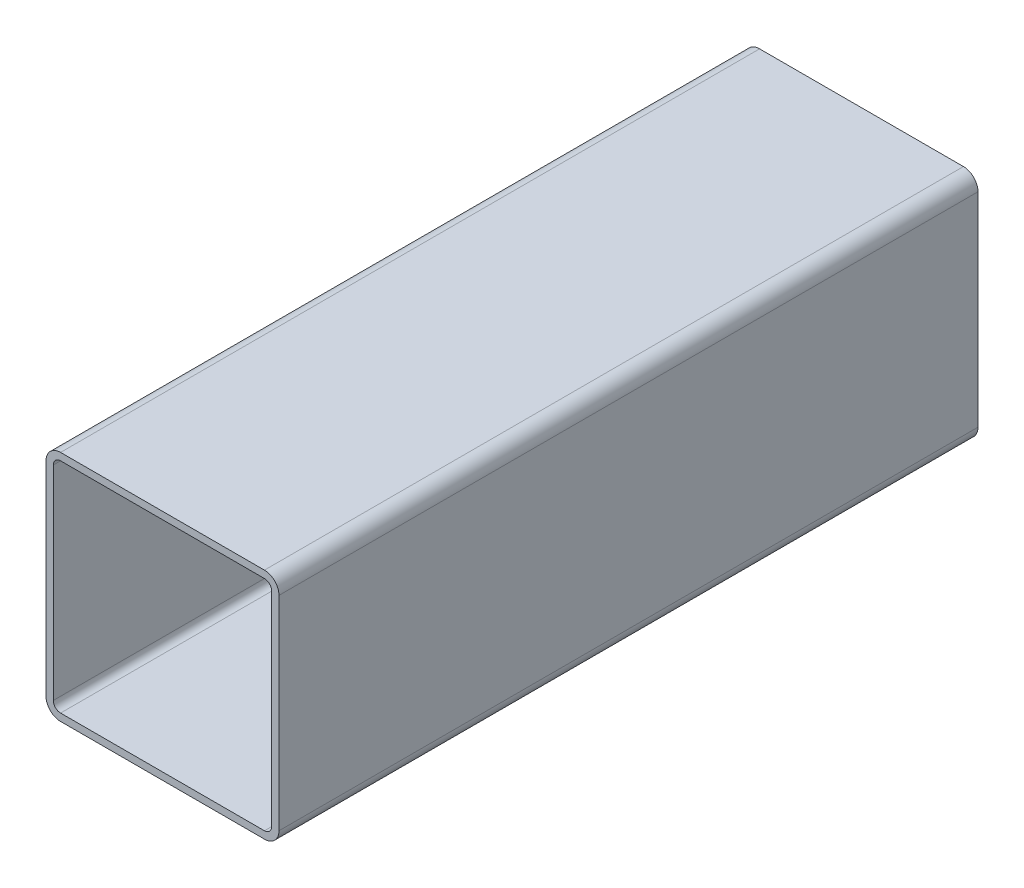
ISO-10303-21;
HEADER;
FILE_DESCRIPTION(('STEP AP214'),'2;1');
FILE_NAME('part.step','',(''),(''),'','','');
FILE_SCHEMA(('AUTOMOTIVE_DESIGN { 1 0 10303 214 1 1 1 1 }'));
ENDSEC;
DATA;
#1=APPLICATION_CONTEXT('core data for automotive mechanical design processes');
#2=APPLICATION_PROTOCOL_DEFINITION('international standard','automotive_design',2000,#1);
#3=PRODUCT_CONTEXT('',#1,'mechanical');
#4=PRODUCT('Part','Part','',(#3));
#5=PRODUCT_RELATED_PRODUCT_CATEGORY('part','',(#4));
#6=PRODUCT_DEFINITION_FORMATION('','',#4);
#7=PRODUCT_DEFINITION_CONTEXT('part definition',#1,'design');
#8=PRODUCT_DEFINITION('design','',#6,#7);
#9=PRODUCT_DEFINITION_SHAPE('','',#8);
#10=(LENGTH_UNIT() NAMED_UNIT(*) SI_UNIT(.MILLI.,.METRE.));
#11=(NAMED_UNIT(*) PLANE_ANGLE_UNIT() SI_UNIT($,.RADIAN.));
#12=(NAMED_UNIT(*) SI_UNIT($,.STERADIAN.) SOLID_ANGLE_UNIT());
#13=UNCERTAINTY_MEASURE_WITH_UNIT(LENGTH_MEASURE(1.E-05),#10,'distance_accuracy_value','');
#14=(GEOMETRIC_REPRESENTATION_CONTEXT(3) GLOBAL_UNCERTAINTY_ASSIGNED_CONTEXT((#13)) GLOBAL_UNIT_ASSIGNED_CONTEXT((#10,
#11,#12)) REPRESENTATION_CONTEXT('',''));
#15=CARTESIAN_POINT('',(0.,0.,0.));
#16=DIRECTION('',(0.,0.,1.));
#17=DIRECTION('',(1.,0.,0.));
#18=AXIS2_PLACEMENT_3D('',#15,#16,#17);
#19=CARTESIAN_POINT('',(8.02517782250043,97.3077651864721,304.8));
#20=DIRECTION('',(0.,0.,1.));
#21=DIRECTION('',(1.,0.,0.));
#22=AXIS2_PLACEMENT_3D('',#19,#20,#21);
#23=PLANE('',#22);
#24=CARTESIAN_POINT('',(8.02517782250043,97.3077651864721,304.8));
#25=DIRECTION('',(0.,0.,1.));
#26=DIRECTION('',(1.,0.,0.));
#27=AXIS2_PLACEMENT_3D('',#24,#25,#26);
#28=CIRCLE('',#27,6.35);
#29=CARTESIAN_POINT('',(8.02517782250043,103.657765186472,304.8));
#30=VERTEX_POINT('',#29);
#31=CARTESIAN_POINT('',(1.67517782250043,97.3077651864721,304.8));
#32=VERTEX_POINT('',#31);
#33=EDGE_CURVE('E211',#30,#32,#28,.T.);
#34=ORIENTED_EDGE('',*,*,#33,.T.);
#35=DIRECTION('',(0.,-1.,0.));
#36=VECTOR('',#35,1.);
#37=CARTESIAN_POINT('',(1.67517782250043,8.40776518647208,304.8));
#38=LINE('',#37,#36);
#39=CARTESIAN_POINT('',(1.67517782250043,8.40776518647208,304.8));
#40=VERTEX_POINT('',#39);
#41=EDGE_CURVE('E214',#32,#40,#38,.T.);
#42=ORIENTED_EDGE('',*,*,#41,.T.);
#43=CARTESIAN_POINT('',(8.02517782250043,8.40776518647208,304.8));
#44=DIRECTION('',(0.,0.,1.));
#45=DIRECTION('',(1.,0.,0.));
#46=AXIS2_PLACEMENT_3D('',#43,#44,#45);
#47=CIRCLE('',#46,6.35);
#48=CARTESIAN_POINT('',(8.02517782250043,2.05776518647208,304.8));
#49=VERTEX_POINT('',#48);
#50=EDGE_CURVE('E217',#40,#49,#47,.T.);
#51=ORIENTED_EDGE('',*,*,#50,.T.);
#52=DIRECTION('',(1.,0.,0.));
#53=VECTOR('',#52,1.);
#54=CARTESIAN_POINT('',(96.9251778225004,2.05776518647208,304.8));
#55=LINE('',#54,#53);
#56=CARTESIAN_POINT('',(96.9251778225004,2.05776518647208,304.8));
#57=VERTEX_POINT('',#56);
#58=EDGE_CURVE('E219',#49,#57,#55,.T.);
#59=ORIENTED_EDGE('',*,*,#58,.T.);
#60=CARTESIAN_POINT('',(96.9251778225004,8.40776518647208,304.8));
#61=DIRECTION('',(0.,0.,1.));
#62=DIRECTION('',(1.,0.,0.));
#63=AXIS2_PLACEMENT_3D('',#60,#61,#62);
#64=CIRCLE('',#63,6.35);
#65=CARTESIAN_POINT('',(103.2751778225,8.40776518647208,304.8));
#66=VERTEX_POINT('',#65);
#67=EDGE_CURVE('E221',#57,#66,#64,.T.);
#68=ORIENTED_EDGE('',*,*,#67,.T.);
#69=DIRECTION('',(0.,1.,0.));
#70=VECTOR('',#69,1.);
#71=CARTESIAN_POINT('',(103.2751778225,97.3077651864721,304.8));
#72=LINE('',#71,#70);
#73=CARTESIAN_POINT('',(103.2751778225,97.3077651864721,304.8));
#74=VERTEX_POINT('',#73);
#75=EDGE_CURVE('E223',#66,#74,#72,.T.);
#76=ORIENTED_EDGE('',*,*,#75,.T.);
#77=CARTESIAN_POINT('',(96.9251778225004,97.3077651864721,304.8));
#78=DIRECTION('',(0.,0.,1.));
#79=DIRECTION('',(1.,0.,0.));
#80=AXIS2_PLACEMENT_3D('',#77,#78,#79);
#81=CIRCLE('',#80,6.35);
#82=CARTESIAN_POINT('',(96.9251778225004,103.657765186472,304.8));
#83=VERTEX_POINT('',#82);
#84=EDGE_CURVE('E225',#74,#83,#81,.T.);
#85=ORIENTED_EDGE('',*,*,#84,.T.);
#86=DIRECTION('',(-1.,0.,0.));
#87=VECTOR('',#86,1.);
#88=CARTESIAN_POINT('',(8.02517782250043,103.657765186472,304.8));
#89=LINE('',#88,#87);
#90=EDGE_CURVE('E227',#83,#30,#89,.T.);
#91=ORIENTED_EDGE('',*,*,#90,.T.);
#92=EDGE_LOOP('',(#34,#42,#51,#59,#68,#76,#85,#91));
#93=FACE_BOUND('',#92,.T.);
#94=DIRECTION('',(0.,-1.,0.));
#95=VECTOR('',#94,1.);
#96=CARTESIAN_POINT('',(4.85017782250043,8.40776518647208,304.8));
#97=LINE('',#96,#95);
#98=CARTESIAN_POINT('',(4.85017782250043,97.3077651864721,304.8));
#99=VERTEX_POINT('',#98);
#100=CARTESIAN_POINT('',(4.85017782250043,8.40776518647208,304.8));
#101=VERTEX_POINT('',#100);
#102=EDGE_CURVE('E154',#99,#101,#97,.T.);
#103=ORIENTED_EDGE('',*,*,#102,.F.);
#104=CARTESIAN_POINT('',(8.02517782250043,97.3077651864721,304.8));
#105=DIRECTION('',(0.,0.,1.));
#106=DIRECTION('',(1.,0.,0.));
#107=AXIS2_PLACEMENT_3D('',#104,#105,#106);
#108=CIRCLE('',#107,3.17500000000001);
#109=CARTESIAN_POINT('',(8.02517782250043,100.482765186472,304.8));
#110=VERTEX_POINT('',#109);
#111=EDGE_CURVE('E146',#110,#99,#108,.T.);
#112=ORIENTED_EDGE('',*,*,#111,.F.);
#113=DIRECTION('',(-1.,0.,0.));
#114=VECTOR('',#113,1.);
#115=CARTESIAN_POINT('',(8.02517782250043,100.482765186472,304.8));
#116=LINE('',#115,#114);
#117=CARTESIAN_POINT('',(96.9251778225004,100.482765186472,304.8));
#118=VERTEX_POINT('',#117);
#119=EDGE_CURVE('E179',#118,#110,#116,.T.);
#120=ORIENTED_EDGE('',*,*,#119,.F.);
#121=CARTESIAN_POINT('',(96.9251778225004,97.3077651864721,304.8));
#122=DIRECTION('',(0.,0.,1.));
#123=DIRECTION('',(1.,0.,0.));
#124=AXIS2_PLACEMENT_3D('',#121,#122,#123);
#125=CIRCLE('',#124,3.175);
#126=CARTESIAN_POINT('',(100.1001778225,97.3077651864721,304.8));
#127=VERTEX_POINT('',#126);
#128=EDGE_CURVE('E177',#127,#118,#125,.T.);
#129=ORIENTED_EDGE('',*,*,#128,.F.);
#130=DIRECTION('',(0.,1.,0.));
#131=VECTOR('',#130,1.);
#132=CARTESIAN_POINT('',(100.1001778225,97.3077651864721,304.8));
#133=LINE('',#132,#131);
#134=CARTESIAN_POINT('',(100.1001778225,8.40776518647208,304.8));
#135=VERTEX_POINT('',#134);
#136=EDGE_CURVE('E175',#135,#127,#133,.T.);
#137=ORIENTED_EDGE('',*,*,#136,.F.);
#138=CARTESIAN_POINT('',(96.9251778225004,8.40776518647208,304.8));
#139=DIRECTION('',(0.,0.,1.));
#140=DIRECTION('',(1.,0.,0.));
#141=AXIS2_PLACEMENT_3D('',#138,#139,#140);
#142=CIRCLE('',#141,3.175);
#143=CARTESIAN_POINT('',(96.9251778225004,5.23276518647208,304.8));
#144=VERTEX_POINT('',#143);
#145=EDGE_CURVE('E173',#144,#135,#142,.T.);
#146=ORIENTED_EDGE('',*,*,#145,.F.);
#147=DIRECTION('',(1.,0.,0.));
#148=VECTOR('',#147,1.);
#149=CARTESIAN_POINT('',(96.9251778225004,5.23276518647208,304.8));
#150=LINE('',#149,#148);
#151=CARTESIAN_POINT('',(8.02517782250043,5.23276518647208,304.8));
#152=VERTEX_POINT('',#151);
#153=EDGE_CURVE('E169',#152,#144,#150,.T.);
#154=ORIENTED_EDGE('',*,*,#153,.F.);
#155=CARTESIAN_POINT('',(8.02517782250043,8.40776518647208,304.8));
#156=DIRECTION('',(0.,0.,1.));
#157=DIRECTION('',(1.,0.,0.));
#158=AXIS2_PLACEMENT_3D('',#155,#156,#157);
#159=CIRCLE('',#158,3.175);
#160=EDGE_CURVE('E167',#101,#152,#159,.T.);
#161=ORIENTED_EDGE('',*,*,#160,.F.);
#162=EDGE_LOOP('',(#103,#112,#120,#129,#137,#146,#154,#161));
#163=FACE_BOUND('',#162,.T.);
#164=ADVANCED_FACE('F33',(#93,#163),#23,.T.);
#165=CARTESIAN_POINT('',(8.02517782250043,97.3077651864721,0.));
#166=DIRECTION('',(0.,0.,1.));
#167=DIRECTION('',(1.,0.,0.));
#168=AXIS2_PLACEMENT_3D('',#165,#166,#167);
#169=PLANE('',#168);
#170=CARTESIAN_POINT('',(8.02517782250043,97.3077651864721,0.));
#171=DIRECTION('',(0.,0.,1.));
#172=DIRECTION('',(1.,0.,0.));
#173=AXIS2_PLACEMENT_3D('',#170,#171,#172);
#174=CIRCLE('',#173,6.35);
#175=CARTESIAN_POINT('',(8.02517782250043,103.657765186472,0.));
#176=VERTEX_POINT('',#175);
#177=CARTESIAN_POINT('',(1.67517782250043,97.3077651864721,0.));
#178=VERTEX_POINT('',#177);
#179=EDGE_CURVE('E162',#176,#178,#174,.T.);
#180=ORIENTED_EDGE('',*,*,#179,.F.);
#181=DIRECTION('',(-1.,0.,0.));
#182=VECTOR('',#181,1.);
#183=CARTESIAN_POINT('',(8.02517782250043,103.657765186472,0.));
#184=LINE('',#183,#182);
#185=CARTESIAN_POINT('',(96.9251778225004,103.657765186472,0.));
#186=VERTEX_POINT('',#185);
#187=EDGE_CURVE('E215',#186,#176,#184,.T.);
#188=ORIENTED_EDGE('',*,*,#187,.F.);
#189=CARTESIAN_POINT('',(96.9251778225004,97.3077651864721,0.));
#190=DIRECTION('',(0.,0.,1.));
#191=DIRECTION('',(1.,0.,0.));
#192=AXIS2_PLACEMENT_3D('',#189,#190,#191);
#193=CIRCLE('',#192,6.35);
#194=CARTESIAN_POINT('',(103.2751778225,97.3077651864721,0.));
#195=VERTEX_POINT('',#194);
#196=EDGE_CURVE('E242',#195,#186,#193,.T.);
#197=ORIENTED_EDGE('',*,*,#196,.F.);
#198=DIRECTION('',(0.,1.,0.));
#199=VECTOR('',#198,1.);
#200=CARTESIAN_POINT('',(103.2751778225,97.3077651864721,0.));
#201=LINE('',#200,#199);
#202=CARTESIAN_POINT('',(103.2751778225,8.40776518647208,0.));
#203=VERTEX_POINT('',#202);
#204=EDGE_CURVE('E240',#203,#195,#201,.T.);
#205=ORIENTED_EDGE('',*,*,#204,.F.);
#206=CARTESIAN_POINT('',(96.9251778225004,8.40776518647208,0.));
#207=DIRECTION('',(0.,0.,1.));
#208=DIRECTION('',(1.,0.,0.));
#209=AXIS2_PLACEMENT_3D('',#206,#207,#208);
#210=CIRCLE('',#209,6.35);
#211=CARTESIAN_POINT('',(96.9251778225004,2.05776518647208,0.));
#212=VERTEX_POINT('',#211);
#213=EDGE_CURVE('E238',#212,#203,#210,.T.);
#214=ORIENTED_EDGE('',*,*,#213,.F.);
#215=DIRECTION('',(1.,0.,0.));
#216=VECTOR('',#215,1.);
#217=CARTESIAN_POINT('',(96.9251778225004,2.05776518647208,0.));
#218=LINE('',#217,#216);
#219=CARTESIAN_POINT('',(8.02517782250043,2.05776518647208,0.));
#220=VERTEX_POINT('',#219);
#221=EDGE_CURVE('E236',#220,#212,#218,.T.);
#222=ORIENTED_EDGE('',*,*,#221,.F.);
#223=CARTESIAN_POINT('',(8.02517782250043,8.40776518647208,0.));
#224=DIRECTION('',(0.,0.,1.));
#225=DIRECTION('',(1.,0.,0.));
#226=AXIS2_PLACEMENT_3D('',#223,#224,#225);
#227=CIRCLE('',#226,6.35);
#228=CARTESIAN_POINT('',(1.67517782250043,8.40776518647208,0.));
#229=VERTEX_POINT('',#228);
#230=EDGE_CURVE('E234',#229,#220,#227,.T.);
#231=ORIENTED_EDGE('',*,*,#230,.F.);
#232=DIRECTION('',(0.,-1.,0.));
#233=VECTOR('',#232,1.);
#234=CARTESIAN_POINT('',(1.67517782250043,8.40776518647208,0.));
#235=LINE('',#234,#233);
#236=EDGE_CURVE('E232',#178,#229,#235,.T.);
#237=ORIENTED_EDGE('',*,*,#236,.F.);
#238=EDGE_LOOP('',(#180,#188,#197,#205,#214,#222,#231,#237));
#239=FACE_BOUND('',#238,.T.);
#240=CARTESIAN_POINT('',(8.02517782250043,97.3077651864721,0.));
#241=DIRECTION('',(0.,0.,1.));
#242=DIRECTION('',(1.,0.,0.));
#243=AXIS2_PLACEMENT_3D('',#240,#241,#242);
#244=CIRCLE('',#243,3.17500000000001);
#245=CARTESIAN_POINT('',(8.02517782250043,100.482765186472,0.));
#246=VERTEX_POINT('',#245);
#247=CARTESIAN_POINT('',(4.85017782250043,97.3077651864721,0.));
#248=VERTEX_POINT('',#247);
#249=EDGE_CURVE('E56',#246,#248,#244,.T.);
#250=ORIENTED_EDGE('',*,*,#249,.T.);
#251=DIRECTION('',(0.,-1.,0.));
#252=VECTOR('',#251,1.);
#253=CARTESIAN_POINT('',(4.85017782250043,8.40776518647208,0.));
#254=LINE('',#253,#252);
#255=CARTESIAN_POINT('',(4.85017782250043,8.40776518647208,0.));
#256=VERTEX_POINT('',#255);
#257=EDGE_CURVE('E161',#248,#256,#254,.T.);
#258=ORIENTED_EDGE('',*,*,#257,.T.);
#259=CARTESIAN_POINT('',(8.02517782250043,8.40776518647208,0.));
#260=DIRECTION('',(0.,0.,1.));
#261=DIRECTION('',(1.,0.,0.));
#262=AXIS2_PLACEMENT_3D('',#259,#260,#261);
#263=CIRCLE('',#262,3.175);
#264=CARTESIAN_POINT('',(8.02517782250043,5.23276518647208,0.));
#265=VERTEX_POINT('',#264);
#266=EDGE_CURVE('E183',#256,#265,#263,.T.);
#267=ORIENTED_EDGE('',*,*,#266,.T.);
#268=DIRECTION('',(1.,0.,0.));
#269=VECTOR('',#268,1.);
#270=CARTESIAN_POINT('',(96.9251778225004,5.23276518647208,0.));
#271=LINE('',#270,#269);
#272=CARTESIAN_POINT('',(96.9251778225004,5.23276518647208,0.));
#273=VERTEX_POINT('',#272);
#274=EDGE_CURVE('E186',#265,#273,#271,.T.);
#275=ORIENTED_EDGE('',*,*,#274,.T.);
#276=CARTESIAN_POINT('',(96.9251778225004,8.40776518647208,0.));
#277=DIRECTION('',(0.,0.,1.));
#278=DIRECTION('',(1.,0.,0.));
#279=AXIS2_PLACEMENT_3D('',#276,#277,#278);
#280=CIRCLE('',#279,3.175);
#281=CARTESIAN_POINT('',(100.1001778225,8.40776518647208,0.));
#282=VERTEX_POINT('',#281);
#283=EDGE_CURVE('E189',#273,#282,#280,.T.);
#284=ORIENTED_EDGE('',*,*,#283,.T.);
#285=DIRECTION('',(0.,1.,0.));
#286=VECTOR('',#285,1.);
#287=CARTESIAN_POINT('',(100.1001778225,97.3077651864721,0.));
#288=LINE('',#287,#286);
#289=CARTESIAN_POINT('',(100.1001778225,97.3077651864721,0.));
#290=VERTEX_POINT('',#289);
#291=EDGE_CURVE('E192',#282,#290,#288,.T.);
#292=ORIENTED_EDGE('',*,*,#291,.T.);
#293=CARTESIAN_POINT('',(96.9251778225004,97.3077651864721,0.));
#294=DIRECTION('',(0.,0.,1.));
#295=DIRECTION('',(1.,0.,0.));
#296=AXIS2_PLACEMENT_3D('',#293,#294,#295);
#297=CIRCLE('',#296,3.175);
#298=CARTESIAN_POINT('',(96.9251778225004,100.482765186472,0.));
#299=VERTEX_POINT('',#298);
#300=EDGE_CURVE('E195',#290,#299,#297,.T.);
#301=ORIENTED_EDGE('',*,*,#300,.T.);
#302=DIRECTION('',(-1.,0.,0.));
#303=VECTOR('',#302,1.);
#304=CARTESIAN_POINT('',(8.02517782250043,100.482765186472,0.));
#305=LINE('',#304,#303);
#306=EDGE_CURVE('E155',#299,#246,#305,.T.);
#307=ORIENTED_EDGE('',*,*,#306,.T.);
#308=EDGE_LOOP('',(#250,#258,#267,#275,#284,#292,#301,#307));
#309=FACE_BOUND('',#308,.T.);
#310=ADVANCED_FACE('F272',(#239,#309),#169,.F.);
#311=CARTESIAN_POINT('',(8.02517782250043,97.3077651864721,304.8));
#312=DIRECTION('',(0.,0.,-1.));
#313=DIRECTION('',(-1.,0.,0.));
#314=AXIS2_PLACEMENT_3D('',#311,#312,#313);
#315=CYLINDRICAL_SURFACE('',#314,6.35);
#316=ORIENTED_EDGE('',*,*,#179,.T.);
#317=DIRECTION('',(0.,0.,-1.));
#318=VECTOR('',#317,1.);
#319=CARTESIAN_POINT('',(1.67517782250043,97.3077651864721,304.8));
#320=LINE('',#319,#318);
#321=EDGE_CURVE('E11',#32,#178,#320,.T.);
#322=ORIENTED_EDGE('',*,*,#321,.F.);
#323=ORIENTED_EDGE('',*,*,#33,.F.);
#324=DIRECTION('',(0.,0.,-1.));
#325=VECTOR('',#324,1.);
#326=CARTESIAN_POINT('',(8.02517782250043,103.657765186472,304.8));
#327=LINE('',#326,#325);
#328=EDGE_CURVE('E229',#30,#176,#327,.T.);
#329=ORIENTED_EDGE('',*,*,#328,.T.);
#330=EDGE_LOOP('',(#316,#322,#323,#329));
#331=FACE_BOUND('',#330,.T.);
#332=ADVANCED_FACE('F35',(#331),#315,.T.);
#333=CARTESIAN_POINT('',(1.67517782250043,8.40776518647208,304.8));
#334=DIRECTION('',(1.,0.,0.));
#335=DIRECTION('',(0.,0.,-1.));
#336=AXIS2_PLACEMENT_3D('',#333,#334,#335);
#337=PLANE('',#336);
#338=ORIENTED_EDGE('',*,*,#236,.T.);
#339=DIRECTION('',(0.,0.,-1.));
#340=VECTOR('',#339,1.);
#341=CARTESIAN_POINT('',(1.67517782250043,8.40776518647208,304.8));
#342=LINE('',#341,#340);
#343=EDGE_CURVE('E41',#40,#229,#342,.T.);
#344=ORIENTED_EDGE('',*,*,#343,.F.);
#345=ORIENTED_EDGE('',*,*,#41,.F.);
#346=ORIENTED_EDGE('',*,*,#321,.T.);
#347=EDGE_LOOP('',(#338,#344,#345,#346));
#348=FACE_BOUND('',#347,.T.);
#349=ADVANCED_FACE('F289',(#348),#337,.F.);
#350=CARTESIAN_POINT('',(8.02517782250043,8.40776518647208,304.8));
#351=DIRECTION('',(0.,0.,-1.));
#352=DIRECTION('',(-1.,0.,0.));
#353=AXIS2_PLACEMENT_3D('',#350,#351,#352);
#354=CYLINDRICAL_SURFACE('',#353,6.35);
#355=ORIENTED_EDGE('',*,*,#230,.T.);
#356=DIRECTION('',(0.,0.,-1.));
#357=VECTOR('',#356,1.);
#358=CARTESIAN_POINT('',(8.02517782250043,2.05776518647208,304.8));
#359=LINE('',#358,#357);
#360=EDGE_CURVE('E259',#49,#220,#359,.T.);
#361=ORIENTED_EDGE('',*,*,#360,.F.);
#362=ORIENTED_EDGE('',*,*,#50,.F.);
#363=ORIENTED_EDGE('',*,*,#343,.T.);
#364=EDGE_LOOP('',(#355,#361,#362,#363));
#365=FACE_BOUND('',#364,.T.);
#366=ADVANCED_FACE('F266',(#365),#354,.T.);
#367=CARTESIAN_POINT('',(96.9251778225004,2.05776518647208,304.8));
#368=DIRECTION('',(0.,1.,0.));
#369=DIRECTION('',(0.,0.,1.));
#370=AXIS2_PLACEMENT_3D('',#367,#368,#369);
#371=PLANE('',#370);
#372=ORIENTED_EDGE('',*,*,#221,.T.);
#373=DIRECTION('',(0.,0.,-1.));
#374=VECTOR('',#373,1.);
#375=CARTESIAN_POINT('',(96.9251778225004,2.05776518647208,304.8));
#376=LINE('',#375,#374);
#377=EDGE_CURVE('E256',#57,#212,#376,.T.);
#378=ORIENTED_EDGE('',*,*,#377,.F.);
#379=ORIENTED_EDGE('',*,*,#58,.F.);
#380=ORIENTED_EDGE('',*,*,#360,.T.);
#381=EDGE_LOOP('',(#372,#378,#379,#380));
#382=FACE_BOUND('',#381,.T.);
#383=ADVANCED_FACE('F278',(#382),#371,.F.);
#384=CARTESIAN_POINT('',(96.9251778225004,8.40776518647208,304.8));
#385=DIRECTION('',(0.,0.,-1.));
#386=DIRECTION('',(-1.,0.,0.));
#387=AXIS2_PLACEMENT_3D('',#384,#385,#386);
#388=CYLINDRICAL_SURFACE('',#387,6.35);
#389=ORIENTED_EDGE('',*,*,#213,.T.);
#390=DIRECTION('',(0.,0.,-1.));
#391=VECTOR('',#390,1.);
#392=CARTESIAN_POINT('',(103.2751778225,8.40776518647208,304.8));
#393=LINE('',#392,#391);
#394=EDGE_CURVE('E253',#66,#203,#393,.T.);
#395=ORIENTED_EDGE('',*,*,#394,.F.);
#396=ORIENTED_EDGE('',*,*,#67,.F.);
#397=ORIENTED_EDGE('',*,*,#377,.T.);
#398=EDGE_LOOP('',(#389,#395,#396,#397));
#399=FACE_BOUND('',#398,.T.);
#400=ADVANCED_FACE('F282',(#399),#388,.T.);
#401=CARTESIAN_POINT('',(103.2751778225,97.3077651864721,304.8));
#402=DIRECTION('',(-1.,0.,0.));
#403=DIRECTION('',(0.,0.,1.));
#404=AXIS2_PLACEMENT_3D('',#401,#402,#403);
#405=PLANE('',#404);
#406=ORIENTED_EDGE('',*,*,#204,.T.);
#407=DIRECTION('',(0.,0.,-1.));
#408=VECTOR('',#407,1.);
#409=CARTESIAN_POINT('',(103.2751778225,97.3077651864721,304.8));
#410=LINE('',#409,#408);
#411=EDGE_CURVE('E250',#74,#195,#410,.T.);
#412=ORIENTED_EDGE('',*,*,#411,.F.);
#413=ORIENTED_EDGE('',*,*,#75,.F.);
#414=ORIENTED_EDGE('',*,*,#394,.T.);
#415=EDGE_LOOP('',(#406,#412,#413,#414));
#416=FACE_BOUND('',#415,.T.);
#417=ADVANCED_FACE('F302',(#416),#405,.F.);
#418=CARTESIAN_POINT('',(96.9251778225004,97.3077651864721,304.8));
#419=DIRECTION('',(0.,0.,-1.));
#420=DIRECTION('',(-1.,0.,0.));
#421=AXIS2_PLACEMENT_3D('',#418,#419,#420);
#422=CYLINDRICAL_SURFACE('',#421,6.35);
#423=ORIENTED_EDGE('',*,*,#196,.T.);
#424=DIRECTION('',(0.,0.,-1.));
#425=VECTOR('',#424,1.);
#426=CARTESIAN_POINT('',(96.9251778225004,103.657765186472,304.8));
#427=LINE('',#426,#425);
#428=EDGE_CURVE('E247',#83,#186,#427,.T.);
#429=ORIENTED_EDGE('',*,*,#428,.F.);
#430=ORIENTED_EDGE('',*,*,#84,.F.);
#431=ORIENTED_EDGE('',*,*,#411,.T.);
#432=EDGE_LOOP('',(#423,#429,#430,#431));
#433=FACE_BOUND('',#432,.T.);
#434=ADVANCED_FACE('F300',(#433),#422,.T.);
#435=CARTESIAN_POINT('',(8.02517782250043,103.657765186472,304.8));
#436=DIRECTION('',(0.,-1.,0.));
#437=DIRECTION('',(0.,0.,-1.));
#438=AXIS2_PLACEMENT_3D('',#435,#436,#437);
#439=PLANE('',#438);
#440=ORIENTED_EDGE('',*,*,#187,.T.);
#441=ORIENTED_EDGE('',*,*,#328,.F.);
#442=ORIENTED_EDGE('',*,*,#90,.F.);
#443=ORIENTED_EDGE('',*,*,#428,.T.);
#444=EDGE_LOOP('',(#440,#441,#442,#443));
#445=FACE_BOUND('',#444,.T.);
#446=ADVANCED_FACE('F295',(#445),#439,.F.);
#447=CARTESIAN_POINT('',(8.02517782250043,97.3077651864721,304.8));
#448=DIRECTION('',(0.,0.,-1.));
#449=DIRECTION('',(-1.,0.,0.));
#450=AXIS2_PLACEMENT_3D('',#447,#448,#449);
#451=CYLINDRICAL_SURFACE('',#450,3.17500000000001);
#452=ORIENTED_EDGE('',*,*,#249,.F.);
#453=DIRECTION('',(0.,0.,-1.));
#454=VECTOR('',#453,1.);
#455=CARTESIAN_POINT('',(8.02517782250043,100.482765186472,304.8));
#456=LINE('',#455,#454);
#457=EDGE_CURVE('E150',#110,#246,#456,.T.);
#458=ORIENTED_EDGE('',*,*,#457,.F.);
#459=ORIENTED_EDGE('',*,*,#111,.T.);
#460=DIRECTION('',(0.,0.,-1.));
#461=VECTOR('',#460,1.);
#462=CARTESIAN_POINT('',(4.85017782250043,97.3077651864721,304.8));
#463=LINE('',#462,#461);
#464=EDGE_CURVE('E149',#99,#248,#463,.T.);
#465=ORIENTED_EDGE('',*,*,#464,.T.);
#466=EDGE_LOOP('',(#452,#458,#459,#465));
#467=FACE_BOUND('',#466,.T.);
#468=ADVANCED_FACE('F148',(#467),#451,.F.);
#469=CARTESIAN_POINT('',(4.85017782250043,8.40776518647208,304.8));
#470=DIRECTION('',(1.,0.,0.));
#471=DIRECTION('',(0.,0.,-1.));
#472=AXIS2_PLACEMENT_3D('',#469,#470,#471);
#473=PLANE('',#472);
#474=ORIENTED_EDGE('',*,*,#257,.F.);
#475=ORIENTED_EDGE('',*,*,#464,.F.);
#476=ORIENTED_EDGE('',*,*,#102,.T.);
#477=DIRECTION('',(0.,0.,-1.));
#478=VECTOR('',#477,1.);
#479=CARTESIAN_POINT('',(4.85017782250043,8.40776518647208,304.8));
#480=LINE('',#479,#478);
#481=EDGE_CURVE('E163',#101,#256,#480,.T.);
#482=ORIENTED_EDGE('',*,*,#481,.T.);
#483=EDGE_LOOP('',(#474,#475,#476,#482));
#484=FACE_BOUND('',#483,.T.);
#485=ADVANCED_FACE('F158',(#484),#473,.T.);
#486=CARTESIAN_POINT('',(8.02517782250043,8.40776518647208,304.8));
#487=DIRECTION('',(0.,0.,-1.));
#488=DIRECTION('',(-1.,0.,0.));
#489=AXIS2_PLACEMENT_3D('',#486,#487,#488);
#490=CYLINDRICAL_SURFACE('',#489,3.175);
#491=ORIENTED_EDGE('',*,*,#266,.F.);
#492=ORIENTED_EDGE('',*,*,#481,.F.);
#493=ORIENTED_EDGE('',*,*,#160,.T.);
#494=DIRECTION('',(0.,0.,-1.));
#495=VECTOR('',#494,1.);
#496=CARTESIAN_POINT('',(8.02517782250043,5.23276518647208,304.8));
#497=LINE('',#496,#495);
#498=EDGE_CURVE('E208',#152,#265,#497,.T.);
#499=ORIENTED_EDGE('',*,*,#498,.T.);
#500=EDGE_LOOP('',(#491,#492,#493,#499));
#501=FACE_BOUND('',#500,.T.);
#502=ADVANCED_FACE('F327',(#501),#490,.F.);
#503=CARTESIAN_POINT('',(96.9251778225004,5.23276518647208,304.8));
#504=DIRECTION('',(0.,1.,0.));
#505=DIRECTION('',(0.,0.,1.));
#506=AXIS2_PLACEMENT_3D('',#503,#504,#505);
#507=PLANE('',#506);
#508=ORIENTED_EDGE('',*,*,#274,.F.);
#509=ORIENTED_EDGE('',*,*,#498,.F.);
#510=ORIENTED_EDGE('',*,*,#153,.T.);
#511=DIRECTION('',(0.,0.,-1.));
#512=VECTOR('',#511,1.);
#513=CARTESIAN_POINT('',(96.9251778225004,5.23276518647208,304.8));
#514=LINE('',#513,#512);
#515=EDGE_CURVE('E206',#144,#273,#514,.T.);
#516=ORIENTED_EDGE('',*,*,#515,.T.);
#517=EDGE_LOOP('',(#508,#509,#510,#516));
#518=FACE_BOUND('',#517,.T.);
#519=ADVANCED_FACE('F331',(#518),#507,.T.);
#520=CARTESIAN_POINT('',(96.9251778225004,8.40776518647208,304.8));
#521=DIRECTION('',(0.,0.,-1.));
#522=DIRECTION('',(-1.,0.,0.));
#523=AXIS2_PLACEMENT_3D('',#520,#521,#522);
#524=CYLINDRICAL_SURFACE('',#523,3.175);
#525=ORIENTED_EDGE('',*,*,#283,.F.);
#526=ORIENTED_EDGE('',*,*,#515,.F.);
#527=ORIENTED_EDGE('',*,*,#145,.T.);
#528=DIRECTION('',(0.,0.,-1.));
#529=VECTOR('',#528,1.);
#530=CARTESIAN_POINT('',(100.1001778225,8.40776518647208,304.8));
#531=LINE('',#530,#529);
#532=EDGE_CURVE('E204',#135,#282,#531,.T.);
#533=ORIENTED_EDGE('',*,*,#532,.T.);
#534=EDGE_LOOP('',(#525,#526,#527,#533));
#535=FACE_BOUND('',#534,.T.);
#536=ADVANCED_FACE('F337',(#535),#524,.F.);
#537=CARTESIAN_POINT('',(100.1001778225,97.3077651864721,304.8));
#538=DIRECTION('',(-1.,0.,0.));
#539=DIRECTION('',(0.,0.,1.));
#540=AXIS2_PLACEMENT_3D('',#537,#538,#539);
#541=PLANE('',#540);
#542=ORIENTED_EDGE('',*,*,#291,.F.);
#543=ORIENTED_EDGE('',*,*,#532,.F.);
#544=ORIENTED_EDGE('',*,*,#136,.T.);
#545=DIRECTION('',(0.,0.,-1.));
#546=VECTOR('',#545,1.);
#547=CARTESIAN_POINT('',(100.1001778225,97.3077651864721,304.8));
#548=LINE('',#547,#546);
#549=EDGE_CURVE('E202',#127,#290,#548,.T.);
#550=ORIENTED_EDGE('',*,*,#549,.T.);
#551=EDGE_LOOP('',(#542,#543,#544,#550));
#552=FACE_BOUND('',#551,.T.);
#553=ADVANCED_FACE('F341',(#552),#541,.T.);
#554=CARTESIAN_POINT('',(96.9251778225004,97.3077651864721,304.8));
#555=DIRECTION('',(0.,0.,-1.));
#556=DIRECTION('',(-1.,0.,0.));
#557=AXIS2_PLACEMENT_3D('',#554,#555,#556);
#558=CYLINDRICAL_SURFACE('',#557,3.175);
#559=ORIENTED_EDGE('',*,*,#300,.F.);
#560=ORIENTED_EDGE('',*,*,#549,.F.);
#561=ORIENTED_EDGE('',*,*,#128,.T.);
#562=DIRECTION('',(0.,0.,-1.));
#563=VECTOR('',#562,1.);
#564=CARTESIAN_POINT('',(96.9251778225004,100.482765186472,304.8));
#565=LINE('',#564,#563);
#566=EDGE_CURVE('E48',#118,#299,#565,.T.);
#567=ORIENTED_EDGE('',*,*,#566,.T.);
#568=EDGE_LOOP('',(#559,#560,#561,#567));
#569=FACE_BOUND('',#568,.T.);
#570=ADVANCED_FACE('F345',(#569),#558,.F.);
#571=CARTESIAN_POINT('',(8.02517782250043,100.482765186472,304.8));
#572=DIRECTION('',(0.,-1.,0.));
#573=DIRECTION('',(0.,0.,-1.));
#574=AXIS2_PLACEMENT_3D('',#571,#572,#573);
#575=PLANE('',#574);
#576=ORIENTED_EDGE('',*,*,#306,.F.);
#577=ORIENTED_EDGE('',*,*,#566,.F.);
#578=ORIENTED_EDGE('',*,*,#119,.T.);
#579=ORIENTED_EDGE('',*,*,#457,.T.);
#580=EDGE_LOOP('',(#576,#577,#578,#579));
#581=FACE_BOUND('',#580,.T.);
#582=ADVANCED_FACE('F349',(#581),#575,.T.);
#583=CLOSED_SHELL('',(#164,#310,#332,#349,#366,#383,#400,#417,#434,#446,#468,#485,#502,#519,
#536,#553,#570,#582));
#584=MANIFOLD_SOLID_BREP('B2',#583);
#585=ADVANCED_BREP_SHAPE_REPRESENTATION('',(#18,#584),#14);
#586=SHAPE_DEFINITION_REPRESENTATION(#9,#585);
ENDSEC;
END-ISO-10303-21;
